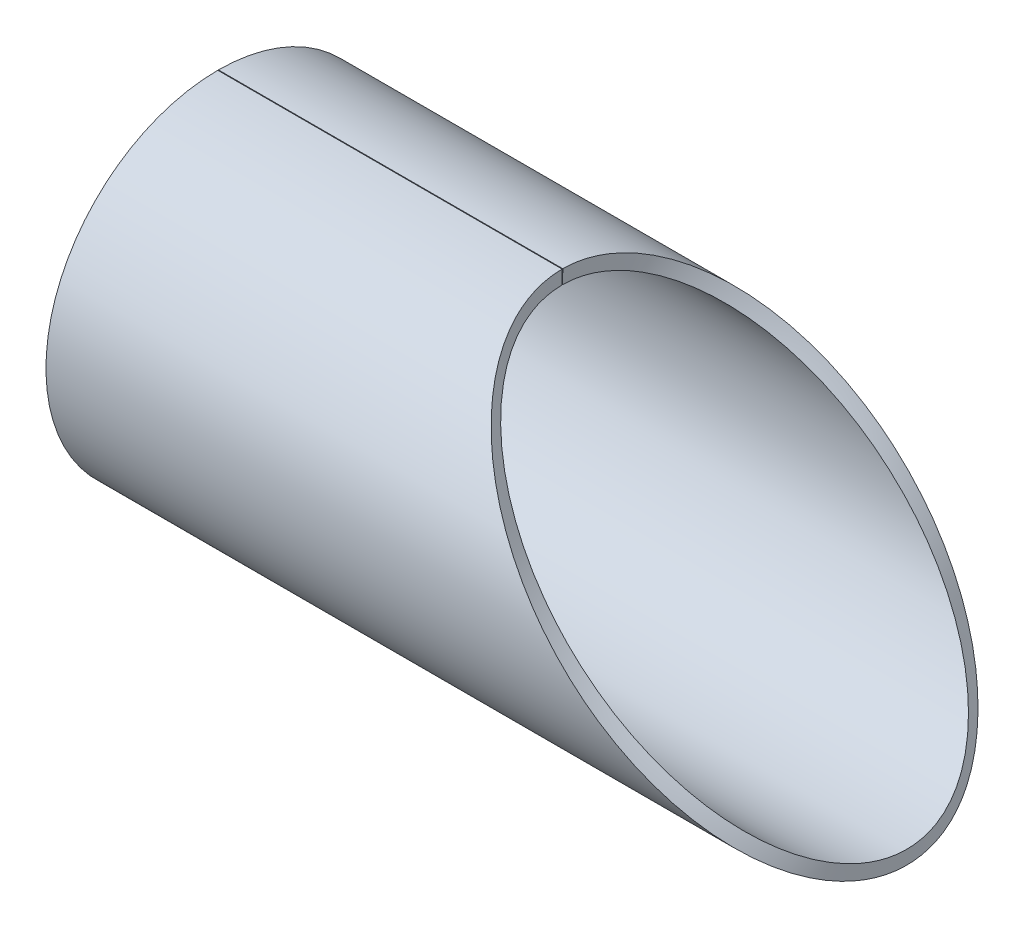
ISO-10303-21;
HEADER;
FILE_DESCRIPTION(('STEP AP214'),'2;1');
FILE_NAME('part.step','',(''),(''),'','','');
FILE_SCHEMA(('AUTOMOTIVE_DESIGN { 1 0 10303 214 1 1 1 1 }'));
ENDSEC;
DATA;
#1=APPLICATION_CONTEXT('core data for automotive mechanical design processes');
#2=APPLICATION_PROTOCOL_DEFINITION('international standard','automotive_design',2000,#1);
#3=PRODUCT_CONTEXT('',#1,'mechanical');
#4=PRODUCT('Part','Part','',(#3));
#5=PRODUCT_RELATED_PRODUCT_CATEGORY('part','',(#4));
#6=PRODUCT_DEFINITION_FORMATION('','',#4);
#7=PRODUCT_DEFINITION_CONTEXT('part definition',#1,'design');
#8=PRODUCT_DEFINITION('design','',#6,#7);
#9=PRODUCT_DEFINITION_SHAPE('','',#8);
#10=(LENGTH_UNIT() NAMED_UNIT(*) SI_UNIT(.MILLI.,.METRE.));
#11=(NAMED_UNIT(*) PLANE_ANGLE_UNIT() SI_UNIT($,.RADIAN.));
#12=(NAMED_UNIT(*) SI_UNIT($,.STERADIAN.) SOLID_ANGLE_UNIT());
#13=UNCERTAINTY_MEASURE_WITH_UNIT(LENGTH_MEASURE(1.E-05),#10,'distance_accuracy_value','');
#14=(GEOMETRIC_REPRESENTATION_CONTEXT(3) GLOBAL_UNCERTAINTY_ASSIGNED_CONTEXT((#13)) GLOBAL_UNIT_ASSIGNED_CONTEXT((#10,
#11,#12)) REPRESENTATION_CONTEXT('',''));
#15=CARTESIAN_POINT('',(0.,0.,0.));
#16=DIRECTION('',(0.,0.,1.));
#17=DIRECTION('',(1.,0.,0.));
#18=AXIS2_PLACEMENT_3D('',#15,#16,#17);
#19=CARTESIAN_POINT('',(25.0000250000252,23.6999525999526,0.0473999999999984));
#20=DIRECTION('',(0.,0.00200000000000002,-0.999997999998));
#21=DIRECTION('',(-1.,0.,0.));
#22=AXIS2_PLACEMENT_3D('',#19,#20,#21);
#23=PLANE('',#22);
#24=CARTESIAN_POINT('',(50.0000500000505,22.999953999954,0.0460000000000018));
#25=CARTESIAN_POINT('',(50.0000500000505,24.99994999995,0.0500000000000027));
#26=B_SPLINE_CURVE_WITH_KNOTS('',1,(#24,#25),.UNSPECIFIED.,.F.,.F.,(2,2),(0.,1.),.UNSPECIFIED.);
#27=CARTESIAN_POINT('',(50.0000500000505,22.999953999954,0.0459999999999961));
#28=VERTEX_POINT('',#27);
#29=CARTESIAN_POINT('',(50.0000500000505,24.99994999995,0.0499999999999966));
#30=VERTEX_POINT('',#29);
#31=EDGE_CURVE('E13',#28,#30,#26,.T.);
#32=ORIENTED_EDGE('',*,*,#31,.F.);
#33=DIRECTION('',(-1.,0.,0.));
#34=VECTOR('',#33,1.);
#35=CARTESIAN_POINT('',(231.312034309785,22.999953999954,0.0459999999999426));
#36=LINE('',#35,#34);
#37=CARTESIAN_POINT('',(0.,22.999953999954,0.0459999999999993));
#38=VERTEX_POINT('',#37);
#39=EDGE_CURVE('E195',#28,#38,#36,.T.);
#40=ORIENTED_EDGE('',*,*,#39,.T.);
#41=DIRECTION('',(0.,0.999997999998,0.00199999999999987));
#42=VECTOR('',#41,1.);
#43=CARTESIAN_POINT('',(0.,23.6999525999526,0.0474000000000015));
#44=LINE('',#43,#42);
#45=CARTESIAN_POINT('',(0.,24.99994999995,0.0499999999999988));
#46=VERTEX_POINT('',#45);
#47=EDGE_CURVE('E50',#38,#46,#44,.T.);
#48=ORIENTED_EDGE('',*,*,#47,.T.);
#49=DIRECTION('',(-1.,0.,0.));
#50=VECTOR('',#49,1.);
#51=CARTESIAN_POINT('',(231.312034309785,24.99994999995,0.0499999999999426));
#52=LINE('',#51,#50);
#53=EDGE_CURVE('E101',#30,#46,#52,.T.);
#54=ORIENTED_EDGE('',*,*,#53,.F.);
#55=EDGE_LOOP('',(#32,#40,#48,#54));
#56=FACE_BOUND('',#55,.T.);
#57=ADVANCED_FACE('F36',(#56),#23,.T.);
#58=CARTESIAN_POINT('',(0.,0.,0.));
#59=DIRECTION('',(-1.,0.,0.));
#60=DIRECTION('',(0.,0.,1.));
#61=AXIS2_PLACEMENT_3D('',#58,#59,#60);
#62=PLANE('',#61);
#63=ORIENTED_EDGE('',*,*,#47,.F.);
#64=CARTESIAN_POINT('',(0.,0.,0.));
#65=DIRECTION('',(-1.,0.,0.));
#66=DIRECTION('',(0.,0.,1.));
#67=AXIS2_PLACEMENT_3D('',#64,#65,#66);
#68=CIRCLE('',#67,23.);
#69=CARTESIAN_POINT('',(0.,22.999953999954,-0.0459999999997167));
#70=VERTEX_POINT('',#69);
#71=EDGE_CURVE('E93',#38,#70,#68,.F.);
#72=ORIENTED_EDGE('',*,*,#71,.T.);
#73=DIRECTION('',(0.,0.999997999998,-0.00199999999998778));
#74=VECTOR('',#73,1.);
#75=CARTESIAN_POINT('',(0.,23.6999525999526,-0.0473999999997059));
#76=LINE('',#75,#74);
#77=CARTESIAN_POINT('',(0.,24.99994999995,-0.0499999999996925));
#78=VERTEX_POINT('',#77);
#79=EDGE_CURVE('E88',#70,#78,#76,.T.);
#80=ORIENTED_EDGE('',*,*,#79,.T.);
#81=CARTESIAN_POINT('',(0.,0.,0.));
#82=DIRECTION('',(-1.,0.,0.));
#83=DIRECTION('',(0.,0.,1.));
#84=AXIS2_PLACEMENT_3D('',#81,#82,#83);
#85=CIRCLE('',#84,25.);
#86=EDGE_CURVE('E91',#46,#78,#85,.F.);
#87=ORIENTED_EDGE('',*,*,#86,.F.);
#88=EDGE_LOOP('',(#63,#72,#80,#87));
#89=FACE_BOUND('',#88,.T.);
#90=ADVANCED_FACE('F90',(#89),#62,.T.);
#91=CARTESIAN_POINT('',(25.0000250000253,23.6999525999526,-0.0473999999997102));
#92=DIRECTION('',(0.,-0.00199999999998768,-0.999997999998));
#93=DIRECTION('',(-1.,0.,0.));
#94=AXIS2_PLACEMENT_3D('',#91,#92,#93);
#95=PLANE('',#94);
#96=ORIENTED_EDGE('',*,*,#79,.F.);
#97=DIRECTION('',(-1.,0.,0.));
#98=VECTOR('',#97,1.);
#99=CARTESIAN_POINT('',(231.312034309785,22.999953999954,-0.0459999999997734));
#100=LINE('',#99,#98);
#101=CARTESIAN_POINT('',(50.0000500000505,22.999953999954,-0.0459999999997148));
#102=VERTEX_POINT('',#101);
#103=EDGE_CURVE('E102',#102,#70,#100,.T.);
#104=ORIENTED_EDGE('',*,*,#103,.F.);
#105=CARTESIAN_POINT('',(50.0000500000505,24.99994999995,-0.0499999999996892));
#106=CARTESIAN_POINT('',(50.0000500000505,22.999953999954,-0.0459999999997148));
#107=B_SPLINE_CURVE_WITH_KNOTS('',1,(#105,#106),.UNSPECIFIED.,.F.,.F.,(2,2),(0.,1.),.UNSPECIFIED.);
#108=CARTESIAN_POINT('',(50.0000500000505,24.99994999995,-0.0499999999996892));
#109=VERTEX_POINT('',#108);
#110=EDGE_CURVE('E58',#102,#109,#107,.F.);
#111=ORIENTED_EDGE('',*,*,#110,.T.);
#112=DIRECTION('',(-1.,0.,0.));
#113=VECTOR('',#112,1.);
#114=CARTESIAN_POINT('',(231.312034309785,24.99994999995,-0.0499999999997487));
#115=LINE('',#114,#113);
#116=EDGE_CURVE('E100',#109,#78,#115,.T.);
#117=ORIENTED_EDGE('',*,*,#116,.T.);
#118=EDGE_LOOP('',(#96,#104,#111,#117));
#119=FACE_BOUND('',#118,.T.);
#120=ADVANCED_FACE('F104',(#119),#95,.F.);
#121=CARTESIAN_POINT('',(50.0000500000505,24.99994999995,-0.0499999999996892));
#122=CARTESIAN_POINT('',(50.0016305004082,24.9994612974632,-0.294350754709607));
#123=CARTESIAN_POINT('',(50.004808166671,24.9955102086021,-0.507621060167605));
#124=CARTESIAN_POINT('',(50.0119705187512,24.9879679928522,-0.780870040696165));
#125=CARTESIAN_POINT('',(50.0147585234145,24.9852496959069,-0.862732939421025));
#126=CARTESIAN_POINT('',(50.0211165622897,24.9789104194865,-1.03007026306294));
#127=CARTESIAN_POINT('',(50.024688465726,24.9753333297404,-1.11338319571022));
#128=CARTESIAN_POINT('',(50.0445124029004,24.9554625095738,-1.52815054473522));
#129=CARTESIAN_POINT('',(50.066642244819,24.9333416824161,-1.85377885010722));
#130=CARTESIAN_POINT('',(50.1527118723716,24.8473146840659,-2.83602660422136));
#131=CARTESIAN_POINT('',(50.2360171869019,24.7639922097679,-3.49023949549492));
#132=CARTESIAN_POINT('',(50.5647063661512,24.4353705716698,-5.446190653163));
#133=CARTESIAN_POINT('',(50.8880864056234,24.1119034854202,-6.73974140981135));
#134=CARTESIAN_POINT('',(51.7502468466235,23.2499034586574,-9.28708744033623));
#135=CARTESIAN_POINT('',(52.2873999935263,22.7124395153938,-10.5373648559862));
#136=CARTESIAN_POINT('',(53.580288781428,21.419700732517,-12.9648519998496));
#137=CARTESIAN_POINT('',(54.3389387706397,20.6610239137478,-14.1475586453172));
#138=CARTESIAN_POINT('',(55.6452221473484,19.3547186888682,-15.8399083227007));
#139=CARTESIAN_POINT('',(56.1090596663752,18.891049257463,-16.3909401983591));
#140=CARTESIAN_POINT('',(57.0994500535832,17.9007626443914,-17.4670363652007));
#141=CARTESIAN_POINT('',(57.6252002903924,17.3749314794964,-17.9910330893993));
#142=CARTESIAN_POINT('',(58.7378108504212,16.2621442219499,-19.0028466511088));
#143=CARTESIAN_POINT('',(59.3233651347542,15.6766751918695,-19.4897948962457));
#144=CARTESIAN_POINT('',(60.5709801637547,14.4292687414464,-20.4305274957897));
#145=CARTESIAN_POINT('',(61.2313678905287,13.7688378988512,-20.882716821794));
#146=CARTESIAN_POINT('',(62.2768197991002,12.723213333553,-21.5241035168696));
#147=CARTESIAN_POINT('',(62.6333185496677,12.3666509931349,-21.7311370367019));
#148=CARTESIAN_POINT('',(63.3702785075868,11.6297674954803,-22.134246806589));
#149=CARTESIAN_POINT('',(63.7516951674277,11.2484569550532,-22.3307815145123));
#150=CARTESIAN_POINT('',(64.9347551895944,10.0655560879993,-22.900893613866));
#151=CARTESIAN_POINT('',(65.7752085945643,9.22485385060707,-23.2550569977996));
#152=CARTESIAN_POINT('',(67.1135087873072,7.88647861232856,-23.7281974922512));
#153=CARTESIAN_POINT('',(67.583066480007,7.41713894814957,-23.879982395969));
#154=CARTESIAN_POINT('',(68.5772992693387,6.42313189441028,-24.166317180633));
#155=CARTESIAN_POINT('',(69.1006466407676,5.89976463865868,-24.3004006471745));
#156=CARTESIAN_POINT('',(69.9250141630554,5.07518635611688,-24.4810468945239));
#157=CARTESIAN_POINT('',(70.206361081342,4.79374635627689,-24.5378423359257));
#158=CARTESIAN_POINT('',(70.5662419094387,4.43378439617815,-24.6037987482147));
#159=CARTESIAN_POINT('',(70.63862793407,4.36138408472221,-24.6167380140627));
#160=CARTESIAN_POINT('',(70.7842197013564,4.21576994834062,-24.6420929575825));
#161=CARTESIAN_POINT('',(70.8565217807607,4.14345223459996,-24.6543642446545));
#162=CARTESIAN_POINT('',(71.0834005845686,3.91661485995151,-24.6917722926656));
#163=CARTESIAN_POINT('',(71.2472485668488,3.75289757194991,-24.7173519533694));
#164=CARTESIAN_POINT('',(72.1294657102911,2.87144440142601,-24.8447670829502));
#165=CARTESIAN_POINT('',(73.0367665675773,1.96427871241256,-24.9474268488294));
#166=CARTESIAN_POINT('',(74.4228015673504,0.57736638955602,-24.9948730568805));
#167=CARTESIAN_POINT('',(74.7126040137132,0.287398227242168,-25.0001769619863));
#168=CARTESIAN_POINT('',(75.3173997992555,-0.317402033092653,-24.9998140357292));
#169=CARTESIAN_POINT('',(75.6075459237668,-0.60770974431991,-24.9941574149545));
#170=CARTESIAN_POINT('',(76.4401366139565,-1.44081985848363,-24.9646330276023));
#171=CARTESIAN_POINT('',(76.9452184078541,-1.94623019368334,-24.9283213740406));
#172=CARTESIAN_POINT('',(77.8554246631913,-2.85637323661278,-24.8404941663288));
#173=CARTESIAN_POINT('',(78.260549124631,-3.26113814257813,-24.7889810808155));
#174=CARTESIAN_POINT('',(78.7932678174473,-3.79340469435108,-24.7111762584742));
#175=CARTESIAN_POINT('',(78.9583460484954,-3.95835503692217,-24.6851239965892));
#176=CARTESIAN_POINT('',(79.1872213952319,-4.1871948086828,-24.6469750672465));
#177=CARTESIAN_POINT('',(79.2604425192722,-4.2604316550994,-24.6344134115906));
#178=CARTESIAN_POINT('',(79.40784684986,-4.40785822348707,-24.6084617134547));
#179=CARTESIAN_POINT('',(79.4811294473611,-4.48115505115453,-24.5952178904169));
#180=CARTESIAN_POINT('',(80.7198009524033,-5.72010105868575,-24.3656894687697));
#181=CARTESIAN_POINT('',(81.7782000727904,-6.77854382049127,-24.0842428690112));
#182=CARTESIAN_POINT('',(82.9669372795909,-7.96695177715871,-23.6978932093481));
#183=CARTESIAN_POINT('',(83.1970534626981,-8.19703638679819,-23.6191875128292));
#184=CARTESIAN_POINT('',(83.6482687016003,-8.6482848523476,-23.4577192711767));
#185=CARTESIAN_POINT('',(83.8705339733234,-8.87058719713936,-23.3745145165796));
#186=CARTESIAN_POINT('',(84.5273027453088,-9.52746408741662,-23.1181403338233));
#187=CARTESIAN_POINT('',(84.951779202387,-9.95199944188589,-22.9382163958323));
#188=CARTESIAN_POINT('',(85.7739933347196,-10.7741914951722,-22.5637067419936));
#189=CARTESIAN_POINT('',(86.171731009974,-11.1718494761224,-22.3691215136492));
#190=CARTESIAN_POINT('',(86.9404675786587,-11.9404499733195,-21.9684654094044));
#191=CARTESIAN_POINT('',(87.3101722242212,-12.3101530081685,-21.7631574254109));
#192=CARTESIAN_POINT('',(88.3915183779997,-13.3916692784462,-21.1272986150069));
#193=CARTESIAN_POINT('',(89.0745739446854,-14.0748409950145,-20.6769412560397));
#194=CARTESIAN_POINT('',(90.365001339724,-15.365103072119,-19.7370376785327));
#195=CARTESIAN_POINT('',(90.9702527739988,-15.9701930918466,-19.2493560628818));
#196=CARTESIAN_POINT('',(92.68997482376,-17.6901698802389,-17.7312434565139));
#197=CARTESIAN_POINT('',(93.7100038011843,-18.7100257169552,-16.6440459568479));
#198=CARTESIAN_POINT('',(95.5037024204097,-20.5035895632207,-14.3767918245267));
#199=CARTESIAN_POINT('',(96.2858025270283,-21.285864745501,-13.1854818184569));
#200=CARTESIAN_POINT('',(97.2868288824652,-22.2867146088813,-11.3485062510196));
#201=CARTESIAN_POINT('',(97.5917282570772,-22.5916554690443,-10.7280326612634));
#202=CARTESIAN_POINT('',(98.1475563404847,-23.1476165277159,-9.46897199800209));
#203=CARTESIAN_POINT('',(98.3980634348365,-23.3981628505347,-8.8311898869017));
#204=CARTESIAN_POINT('',(99.0673638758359,-24.0673842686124,-6.90049076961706));
#205=CARTESIAN_POINT('',(99.4031486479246,-24.403220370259,-5.59321612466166));
#206=CARTESIAN_POINT('',(99.8613919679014,-24.8617723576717,-2.94847524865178));
#207=CARTESIAN_POINT('',(99.9834443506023,-24.9835295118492,-1.61228551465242));
#208=CARTESIAN_POINT('',(100.013410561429,-25.0133428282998,1.05303941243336));
#209=CARTESIAN_POINT('',(99.9213160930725,-24.921673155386,2.38915881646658));
#210=CARTESIAN_POINT('',(99.5229631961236,-24.5231604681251,5.04107859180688));
#211=CARTESIAN_POINT('',(99.2174964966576,-24.2174427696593,6.35303141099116));
#212=CARTESIAN_POINT('',(98.3862779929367,-23.386423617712,8.93983963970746));
#213=CARTESIAN_POINT('',(97.8614214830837,-22.8613000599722,10.212115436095));
#214=CARTESIAN_POINT('',(96.5904725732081,-21.590399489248,12.6799444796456));
#215=CARTESIAN_POINT('',(95.8400348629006,-20.8400591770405,13.8839197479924));
#216=CARTESIAN_POINT('',(94.5419334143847,-19.5418598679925,15.6087647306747));
#217=CARTESIAN_POINT('',(94.0807513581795,-19.0808106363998,16.169938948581));
#218=CARTESIAN_POINT('',(93.0938796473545,-18.0941014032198,17.2669555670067));
#219=CARTESIAN_POINT('',(92.5690514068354,-17.5692398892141,17.8016359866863));
#220=CARTESIAN_POINT('',(91.4566101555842,-16.4566114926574,18.8349773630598));
#221=CARTESIAN_POINT('',(90.8709044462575,-15.8708911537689,19.3322434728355));
#222=CARTESIAN_POINT('',(89.6217937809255,-14.6220154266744,20.2932867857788));
#223=CARTESIAN_POINT('',(88.9595041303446,-13.9597485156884,20.7559022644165));
#224=CARTESIAN_POINT('',(87.5594561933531,-12.5594779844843,21.6319571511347));
#225=CARTESIAN_POINT('',(86.8246033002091,-11.8246428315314,22.0443892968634));
#226=CARTESIAN_POINT('',(85.2421861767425,-10.2423935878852,22.8225908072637));
#227=CARTESIAN_POINT('',(84.3987830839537,-9.39876488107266,23.1855608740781));
#228=CARTESIAN_POINT('',(83.2792860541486,-8.27927477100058,23.5904704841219));
#229=CARTESIAN_POINT('',(83.0519754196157,-8.05200624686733,23.6691005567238));
#230=CARTESIAN_POINT('',(82.5821488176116,-7.58232841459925,23.8237155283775));
#231=CARTESIAN_POINT('',(82.3407143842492,-7.34098531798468,23.8993046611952));
#232=CARTESIAN_POINT('',(81.5968476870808,-6.59731764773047,24.1193431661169));
#233=CARTESIAN_POINT('',(81.0748520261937,-6.07532427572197,24.2570902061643));
#234=CARTESIAN_POINT('',(80.2527317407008,-5.25299411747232,24.4435073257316));
#235=CARTESIAN_POINT('',(79.9721705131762,-4.9723345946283,24.502272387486));
#236=CARTESIAN_POINT('',(79.5415469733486,-4.54159194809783,24.5844525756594));
#237=CARTESIAN_POINT('',(79.396375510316,-4.39638605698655,24.610851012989));
#238=CARTESIAN_POINT('',(79.176172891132,-4.17615378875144,24.6488395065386));
#239=CARTESIAN_POINT('',(79.1021642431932,-4.1021425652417,24.6612783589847));
#240=CARTESIAN_POINT('',(78.9463828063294,-3.94641649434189,24.686676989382));
#241=CARTESIAN_POINT('',(78.865470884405,-3.86555366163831,24.6994877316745));
#242=CARTESIAN_POINT('',(78.1100727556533,-3.1107017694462,24.8150013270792));
#243=CARTESIAN_POINT('',(77.2452507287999,-2.24640715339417,24.9214230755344));
#244=CARTESIAN_POINT('',(75.9225269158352,-0.922859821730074,24.9843662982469));
#245=CARTESIAN_POINT('',(75.6458973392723,-0.646043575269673,24.9933201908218));
#246=CARTESIAN_POINT('',(75.2128257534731,-0.212833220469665,24.9995111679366));
#247=CARTESIAN_POINT('',(75.063985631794,-0.0639952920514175,25.00035973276));
#248=CARTESIAN_POINT('',(74.7668030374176,0.233204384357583,24.999353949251));
#249=CARTESIAN_POINT('',(74.621261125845,0.378792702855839,24.9975368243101));
#250=CARTESIAN_POINT('',(73.9087984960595,1.09157515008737,24.9826692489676));
#251=CARTESIAN_POINT('',(73.3876185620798,1.61320728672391,24.9524020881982));
#252=CARTESIAN_POINT('',(72.4428390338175,2.55817928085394,24.8732894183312));
#253=CARTESIAN_POINT('',(72.0192394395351,2.98155093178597,24.8244472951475));
#254=CARTESIAN_POINT('',(71.4570253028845,3.54331152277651,24.7483464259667));
#255=CARTESIAN_POINT('',(71.2818181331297,3.71835839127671,24.7224797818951));
#256=CARTESIAN_POINT('',(70.9557988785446,4.04418165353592,24.6712746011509));
#257=CARTESIAN_POINT('',(70.808394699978,4.19159070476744,24.6465580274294));
#258=CARTESIAN_POINT('',(69.4863233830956,5.5138555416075,24.4135563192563));
#259=CARTESIAN_POINT('',(68.4162966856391,6.58420379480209,24.1385994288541));
#260=CARTESIAN_POINT('',(66.968978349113,8.03105073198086,23.6803326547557));
#261=CARTESIAN_POINT('',(66.5162561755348,8.48371356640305,23.5212893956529));
#262=CARTESIAN_POINT('',(65.6312739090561,9.36878235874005,23.1829758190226));
#263=CARTESIAN_POINT('',(65.2020680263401,9.79806118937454,23.0044704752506));
#264=CARTESIAN_POINT('',(64.3702267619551,10.6299295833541,22.6321068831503));
#265=CARTESIAN_POINT('',(63.967591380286,11.0325204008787,22.4382491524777));
#266=CARTESIAN_POINT('',(63.1888911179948,11.811115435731,22.0383548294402));
#267=CARTESIAN_POINT('',(62.8140209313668,12.1859601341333,21.8330100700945));
#268=CARTESIAN_POINT('',(61.719682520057,13.2804568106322,21.1976715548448));
#269=CARTESIAN_POINT('',(61.0283628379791,13.9719297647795,20.7468901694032));
#270=CARTESIAN_POINT('',(60.0487422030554,14.951442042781,20.0403704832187));
#271=CARTESIAN_POINT('',(59.731761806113,15.2683461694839,19.7997982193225));
#272=CARTESIAN_POINT('',(59.1169206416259,15.8830658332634,19.3101689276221));
#273=CARTESIAN_POINT('',(58.8194513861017,16.1805145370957,19.0614670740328));
#274=CARTESIAN_POINT('',(57.3697018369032,17.630415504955,17.7917310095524));
#275=CARTESIAN_POINT('',(56.3378342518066,18.6621968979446,16.6986560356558));
#276=CARTESIAN_POINT('',(54.5242807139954,20.4756020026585,14.4177816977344));
#277=CARTESIAN_POINT('',(53.7340564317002,21.2659870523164,13.2186092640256));
#278=CARTESIAN_POINT('',(52.7235487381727,22.2763303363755,11.3691937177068));
#279=CARTESIAN_POINT('',(52.4159238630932,22.5840130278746,10.7444319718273));
#280=CARTESIAN_POINT('',(51.8554118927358,23.144663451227,9.47655087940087));
#281=CARTESIAN_POINT('',(51.6029646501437,23.3971450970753,8.83425780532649));
#282=CARTESIAN_POINT('',(50.9290491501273,24.0709660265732,6.88989355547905));
#283=CARTESIAN_POINT('',(50.5917197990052,24.4083597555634,5.57226096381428));
#284=CARTESIAN_POINT('',(50.2483514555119,24.7516658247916,3.57904574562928));
#285=CARTESIAN_POINT('',(50.1611744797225,24.8388520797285,2.91215109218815));
#286=CARTESIAN_POINT('',(50.0708637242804,24.9291162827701,1.91087951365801));
#287=CARTESIAN_POINT('',(50.0475955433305,24.9523696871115,1.57917170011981));
#288=CARTESIAN_POINT('',(50.0266339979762,24.9733720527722,1.15665328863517));
#289=CARTESIAN_POINT('',(50.0228474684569,24.9771626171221,1.07174468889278));
#290=CARTESIAN_POINT('',(50.0160859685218,24.9839000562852,0.901125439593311));
#291=CARTESIAN_POINT('',(50.0131098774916,24.9867613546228,0.818692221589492));
#292=CARTESIAN_POINT('',(50.0054085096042,24.9947993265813,0.542223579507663));
#293=CARTESIAN_POINT('',(50.0019109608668,24.999416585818,0.316706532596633));
#294=CARTESIAN_POINT('',(50.0000500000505,24.99994999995,0.0500000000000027));
#295=CARTESIAN_POINT('',(50.0000500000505,22.999953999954,-0.0459999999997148));
#296=CARTESIAN_POINT('',(50.001630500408,22.9995043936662,-0.270802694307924));
#297=CARTESIAN_POINT('',(50.004808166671,22.9958693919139,-0.467011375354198));
#298=CARTESIAN_POINT('',(50.0119705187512,22.988930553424,-0.718400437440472));
#299=CARTESIAN_POINT('',(50.0147585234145,22.9864297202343,-0.793714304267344));
#300=CARTESIAN_POINT('',(50.0211165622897,22.9805975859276,-0.947664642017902));
#301=CARTESIAN_POINT('',(50.024688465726,22.9773066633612,-1.0243125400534));
#302=CARTESIAN_POINT('',(50.0445124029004,22.9590255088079,-1.4058985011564));
#303=CARTESIAN_POINT('',(50.066642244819,22.9386743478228,-1.70547654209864));
#304=CARTESIAN_POINT('',(50.1527118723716,22.8595295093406,-2.60914447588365));
#305=CARTESIAN_POINT('',(50.2360171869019,22.7828728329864,-3.21102033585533));
#306=CARTESIAN_POINT('',(50.5647063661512,22.4805409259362,-5.01049540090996));
#307=CARTESIAN_POINT('',(50.8880864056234,22.1829512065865,-6.20056209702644));
#308=CARTESIAN_POINT('',(51.7502468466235,21.3899111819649,-8.54412044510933));
#309=CARTESIAN_POINT('',(52.2873999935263,20.8954443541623,-9.69437566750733));
#310=CARTESIAN_POINT('',(53.580288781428,19.7061246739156,-11.9276638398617));
#311=CARTESIAN_POINT('',(54.3389387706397,19.008142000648,-13.0157539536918));
#312=CARTESIAN_POINT('',(55.6452221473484,17.8063411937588,-14.5727156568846));
#313=CARTESIAN_POINT('',(56.1090596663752,17.379765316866,-15.0796649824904));
#314=CARTESIAN_POINT('',(57.0994500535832,16.4687016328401,-16.0696734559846));
#315=CARTESIAN_POINT('',(57.6252002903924,15.9849369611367,-16.5517504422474));
#316=CARTESIAN_POINT('',(58.7378108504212,14.9611726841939,-17.4826189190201));
#317=CARTESIAN_POINT('',(59.3233651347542,14.4225411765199,-17.930611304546));
#318=CARTESIAN_POINT('',(60.5709801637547,13.2749272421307,-18.7960852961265));
#319=CARTESIAN_POINT('',(61.2313678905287,12.6673308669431,-19.2120994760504));
#320=CARTESIAN_POINT('',(62.2768197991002,11.7053562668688,-19.80217523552));
#321=CARTESIAN_POINT('',(62.6333185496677,11.3773189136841,-19.9926460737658));
#322=CARTESIAN_POINT('',(63.3702785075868,10.6993860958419,-20.3635070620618));
#323=CARTESIAN_POINT('',(63.7516951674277,10.3485803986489,-20.5443189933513));
#324=CARTESIAN_POINT('',(64.9347551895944,9.26031160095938,-21.0688221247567));
#325=CARTESIAN_POINT('',(65.7752085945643,8.4868655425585,-21.3946524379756));
#326=CARTESIAN_POINT('',(67.1135087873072,7.25556032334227,-21.8299416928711));
#327=CARTESIAN_POINT('',(67.583066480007,6.82376783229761,-21.9695838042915));
#328=CARTESIAN_POINT('',(68.5772992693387,5.90928134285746,-22.2330118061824));
#329=CARTESIAN_POINT('',(69.1006466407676,5.42778346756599,-22.3563685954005));
#330=CARTESIAN_POINT('',(69.9250141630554,4.66917144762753,-22.522563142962));
#331=CARTESIAN_POINT('',(70.206361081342,4.41024664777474,-22.5748149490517));
#332=CARTESIAN_POINT('',(70.5662419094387,4.0790816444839,-22.6354948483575));
#333=CARTESIAN_POINT('',(70.63862793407,4.01247335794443,-22.6473989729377));
#334=CARTESIAN_POINT('',(70.7842197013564,3.87850835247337,-22.6707255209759));
#335=CARTESIAN_POINT('',(70.8565217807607,3.81197605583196,-22.6820151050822));
#336=CARTESIAN_POINT('',(71.0834005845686,3.60328567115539,-22.7164305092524));
#337=CARTESIAN_POINT('',(71.2472485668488,3.45266576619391,-22.7399637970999));
#338=CARTESIAN_POINT('',(72.1294657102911,2.64172884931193,-22.8571857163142));
#339=CARTESIAN_POINT('',(73.0367665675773,1.80713641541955,-22.951632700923));
#340=CARTESIAN_POINT('',(74.4228015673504,0.531177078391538,-22.99528321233));
#341=CARTESIAN_POINT('',(74.7126040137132,0.264406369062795,-23.0001628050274));
#342=CARTESIAN_POINT('',(75.3173997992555,-0.292009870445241,-22.9998289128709));
#343=CARTESIAN_POINT('',(75.6075459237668,-0.559092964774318,-22.9946248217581));
#344=CARTESIAN_POINT('',(76.4401366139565,-1.32555426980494,-22.9674623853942));
#345=CARTESIAN_POINT('',(76.9452184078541,-1.79053177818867,-22.9340556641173));
#346=CARTESIAN_POINT('',(77.8554246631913,-2.62786337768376,-22.8532546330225));
#347=CARTESIAN_POINT('',(78.260549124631,-3.00024709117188,-22.8058625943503));
#348=CARTESIAN_POINT('',(78.7932678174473,-3.48993231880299,-22.7342821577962));
#349=CARTESIAN_POINT('',(78.9583460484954,-3.6416866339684,-22.7103140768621));
#350=CARTESIAN_POINT('',(79.1872213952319,-3.85221922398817,-22.6752170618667));
#351=CARTESIAN_POINT('',(79.2604425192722,-3.91959712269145,-22.6636603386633));
#352=CARTESIAN_POINT('',(79.40784684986,-4.0552295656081,-22.6397847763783));
#353=CARTESIAN_POINT('',(79.4811294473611,-4.12266264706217,-22.6276004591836));
#354=CARTESIAN_POINT('',(80.7198009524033,-5.26249297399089,-22.4164343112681));
#355=CARTESIAN_POINT('',(81.7782000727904,-6.23626031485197,-22.1575034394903));
#356=CARTESIAN_POINT('',(82.9669372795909,-7.32959563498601,-21.8020617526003));
#357=CARTESIAN_POINT('',(83.1970534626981,-7.54127347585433,-21.7296525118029));
#358=CARTESIAN_POINT('',(83.6482687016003,-7.95642206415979,-21.5811017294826));
#359=CARTESIAN_POINT('',(83.8705339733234,-8.16094022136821,-21.5045533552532));
#360=CARTESIAN_POINT('',(84.5273027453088,-8.76526696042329,-21.2686891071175));
#361=CARTESIAN_POINT('',(84.951779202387,-9.15583948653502,-21.1031590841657));
#362=CARTESIAN_POINT('',(85.7739933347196,-9.91225617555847,-20.7586102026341));
#363=CARTESIAN_POINT('',(86.171731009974,-10.2781015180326,-20.5795917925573));
#364=CARTESIAN_POINT('',(86.9404675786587,-10.9852139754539,-20.210988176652));
#365=CARTESIAN_POINT('',(87.3101722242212,-11.325340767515,-20.0221048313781));
#366=CARTESIAN_POINT('',(88.3915183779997,-12.3203357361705,-19.4371147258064));
#367=CARTESIAN_POINT('',(89.0745739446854,-12.9488537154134,-19.0227859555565));
#368=CARTESIAN_POINT('',(90.365001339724,-14.1358948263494,-18.15807466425));
#369=CARTESIAN_POINT('',(90.9702527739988,-14.6925776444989,-17.7094075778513));
#370=CARTESIAN_POINT('',(92.68997482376,-16.2749562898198,-16.3127439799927));
#371=CARTESIAN_POINT('',(93.7100038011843,-17.2132236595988,-15.3125222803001));
#372=CARTESIAN_POINT('',(95.5037024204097,-18.8633023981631,-13.2266484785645));
#373=CARTESIAN_POINT('',(96.2858025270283,-19.5829955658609,-12.1306432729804));
#374=CARTESIAN_POINT('',(97.2868288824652,-20.5037774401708,-10.440625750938));
#375=CARTESIAN_POINT('',(97.5917282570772,-20.7843230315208,-9.8697900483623));
#376=CARTESIAN_POINT('',(98.1475563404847,-21.2958072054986,-8.71145423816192));
#377=CARTESIAN_POINT('',(98.3980634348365,-21.5263098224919,-8.12469469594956));
#378=CARTESIAN_POINT('',(99.0673638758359,-22.1419935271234,-6.3484515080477));
#379=CARTESIAN_POINT('',(99.4031486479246,-22.4509627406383,-5.14575883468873));
#380=CARTESIAN_POINT('',(99.8613919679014,-22.8728305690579,-2.71259722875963));
#381=CARTESIAN_POINT('',(99.9834443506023,-22.9848471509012,-1.48330267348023));
#382=CARTESIAN_POINT('',(100.013410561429,-23.0122754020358,0.968796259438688));
#383=CARTESIAN_POINT('',(99.9213160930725,-22.9279393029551,2.19802611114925));
#384=CARTESIAN_POINT('',(99.5229631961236,-22.5613076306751,4.63779230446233));
#385=CARTESIAN_POINT('',(99.2174964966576,-22.2800473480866,5.84478889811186));
#386=CARTESIAN_POINT('',(98.3862779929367,-21.5155097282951,8.22465246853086));
#387=CARTESIAN_POINT('',(97.8614214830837,-21.0323960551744,9.39514620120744));
#388=CARTESIAN_POINT('',(96.5904725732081,-19.8631675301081,11.665548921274));
#389=CARTESIAN_POINT('',(95.8400348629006,-19.1728544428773,12.773206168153));
#390=CARTESIAN_POINT('',(94.5419334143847,-17.9785110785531,14.3600635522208));
#391=CARTESIAN_POINT('',(94.0807513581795,-17.5543457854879,14.8763438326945));
#392=CARTESIAN_POINT('',(93.0938796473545,-16.6465732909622,15.8855991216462));
#393=CARTESIAN_POINT('',(92.5690514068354,-16.1637006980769,16.3775051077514));
#394=CARTESIAN_POINT('',(91.4566101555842,-15.1400825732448,17.328179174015));
#395=CARTESIAN_POINT('',(90.8709044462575,-14.6012198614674,17.7856639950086));
#396=CARTESIAN_POINT('',(89.6217937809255,-13.4522541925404,18.6698238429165));
#397=CARTESIAN_POINT('',(88.9595041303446,-12.8429686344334,19.0954300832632));
#398=CARTESIAN_POINT('',(87.5594561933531,-11.5547197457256,19.9014005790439));
#399=CARTESIAN_POINT('',(86.8246033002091,-10.8786714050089,20.2808381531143));
#400=CARTESIAN_POINT('',(85.2421861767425,-9.42300210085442,20.9967835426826));
#401=CARTESIAN_POINT('',(84.3987830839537,-8.64686369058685,21.3307160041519));
#402=CARTESIAN_POINT('',(83.2792860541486,-7.61693278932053,21.7032328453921));
#403=CARTESIAN_POINT('',(83.0519754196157,-7.40784574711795,21.7755725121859));
#404=CARTESIAN_POINT('',(82.5821488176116,-6.97574214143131,21.9178182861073));
#405=CARTESIAN_POINT('',(82.3407143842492,-6.7537064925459,21.9873602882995));
#406=CARTESIAN_POINT('',(81.5968476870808,-6.06953223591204,22.1897957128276));
#407=CARTESIAN_POINT('',(81.0748520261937,-5.58929833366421,22.3165229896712));
#408=CARTESIAN_POINT('',(80.2527317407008,-4.83275458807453,22.488026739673));
#409=CARTESIAN_POINT('',(79.9721705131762,-4.57454782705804,22.5420905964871));
#410=CARTESIAN_POINT('',(79.5415469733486,-4.17826459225,22.6176963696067));
#411=CARTESIAN_POINT('',(79.396375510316,-4.04467517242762,22.6419829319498));
#412=CARTESIAN_POINT('',(79.176172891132,-3.84206148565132,22.6769323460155));
#413=CARTESIAN_POINT('',(79.1021642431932,-3.77397116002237,22.6883760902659));
#414=CARTESIAN_POINT('',(78.9463828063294,-3.63070317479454,22.7117428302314));
#415=CARTESIAN_POINT('',(78.865470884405,-3.55630936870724,22.7235287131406));
#416=CARTESIAN_POINT('',(78.1100727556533,-2.86184562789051,22.8298012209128));
#417=CARTESIAN_POINT('',(77.2452507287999,-2.06669458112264,22.9277092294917));
#418=CARTESIAN_POINT('',(75.9225269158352,-0.849031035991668,22.9856169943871));
#419=CARTESIAN_POINT('',(75.6458973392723,-0.594360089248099,22.9938545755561));
#420=CARTESIAN_POINT('',(75.2128257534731,-0.195806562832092,22.9995502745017));
#421=CARTESIAN_POINT('',(75.063985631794,-0.0588756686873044,23.0003309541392));
#422=CARTESIAN_POINT('',(74.7668030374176,0.214548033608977,22.9994056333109));
#423=CARTESIAN_POINT('',(74.621261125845,0.348489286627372,22.9977338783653));
#424=CARTESIAN_POINT('',(73.9087984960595,1.00424913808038,22.9840557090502));
#425=CARTESIAN_POINT('',(73.3876185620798,1.484150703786,22.9562099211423));
#426=CARTESIAN_POINT('',(72.4428390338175,2.35352493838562,22.8834262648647));
#427=CARTESIAN_POINT('',(72.0192394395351,2.7430268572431,22.8384915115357));
#428=CARTESIAN_POINT('',(71.4570253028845,3.25984660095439,22.7684787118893));
#429=CARTESIAN_POINT('',(71.2818181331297,3.42088971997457,22.7446813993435));
#430=CARTESIAN_POINT('',(70.9557988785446,3.72064712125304,22.6975726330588));
#431=CARTESIAN_POINT('',(70.808394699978,3.85626344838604,22.674833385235));
#432=CARTESIAN_POINT('',(69.4863233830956,5.0727470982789,22.4604718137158));
#433=CARTESIAN_POINT('',(68.4162966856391,6.05746749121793,22.2075114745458));
#434=CARTESIAN_POINT('',(66.968978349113,7.38856667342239,21.7859060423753));
#435=CARTESIAN_POINT('',(66.5162561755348,7.8050164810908,21.6395862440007));
#436=CARTESIAN_POINT('',(65.6312739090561,8.61927977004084,21.3283377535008));
#437=CARTESIAN_POINT('',(65.2020680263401,9.01421629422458,21.1641128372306));
#438=CARTESIAN_POINT('',(64.3702267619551,9.77953521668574,20.8215383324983));
#439=CARTESIAN_POINT('',(63.967591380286,10.1499187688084,20.6431892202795));
#440=CARTESIAN_POINT('',(63.1888911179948,10.8662262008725,20.275286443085));
#441=CARTESIAN_POINT('',(62.8140209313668,11.2110833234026,20.086369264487));
#442=CARTESIAN_POINT('',(61.719682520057,12.2180202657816,19.5018578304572));
#443=CARTESIAN_POINT('',(61.0283628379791,12.8541753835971,19.0871389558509));
#444=CARTESIAN_POINT('',(60.0487422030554,13.7553266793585,18.4371408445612));
#445=CARTESIAN_POINT('',(59.731761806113,14.0468784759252,18.2158143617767));
#446=CARTESIAN_POINT('',(59.1169206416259,14.6124205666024,17.7653554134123));
#447=CARTESIAN_POINT('',(58.8194513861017,14.8860733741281,17.5365497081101));
#448=CARTESIAN_POINT('',(57.3697018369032,16.2199822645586,16.3683925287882));
#449=CARTESIAN_POINT('',(56.3378342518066,17.169221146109,15.3627635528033));
#450=CARTESIAN_POINT('',(54.5242807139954,18.8375538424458,13.2643591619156));
#451=CARTESIAN_POINT('',(53.7340564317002,19.5647080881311,12.1611205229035));
#452=CARTESIAN_POINT('',(52.7235487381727,20.4942239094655,10.4596582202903));
#453=CARTESIAN_POINT('',(52.4159238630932,20.7772919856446,9.88487741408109));
#454=CARTESIAN_POINT('',(51.8554118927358,21.2930903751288,8.7184268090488));
#455=CARTESIAN_POINT('',(51.6029646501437,21.5253734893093,8.12751718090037));
#456=CARTESIAN_POINT('',(50.9290491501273,22.1452887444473,6.33870207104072));
#457=CARTESIAN_POINT('',(50.5917197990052,22.4556909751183,5.12648008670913));
#458=CARTESIAN_POINT('',(50.2483514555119,22.7715325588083,3.29272208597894));
#459=CARTESIAN_POINT('',(50.1611744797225,22.8517439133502,2.6791790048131));
#460=CARTESIAN_POINT('',(50.0708637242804,22.9347869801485,1.75800915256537));
#461=CARTESIAN_POINT('',(50.0475955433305,22.9561801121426,1.45283796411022));
#462=CARTESIAN_POINT('',(50.0266339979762,22.9755022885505,1.06412102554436));
#463=CARTESIAN_POINT('',(50.0228474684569,22.9789896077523,0.98600511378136));
#464=CARTESIAN_POINT('',(50.0160859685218,22.9851880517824,0.829035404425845));
#465=CARTESIAN_POINT('',(50.0131098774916,22.9878204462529,0.753196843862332));
#466=CARTESIAN_POINT('',(50.0054085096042,22.9952153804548,0.498845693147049));
#467=CARTESIAN_POINT('',(50.0019109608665,22.9994632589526,0.291370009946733));
#468=CARTESIAN_POINT('',(50.0000500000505,22.999953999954,0.0460000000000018));
#469=B_SPLINE_SURFACE_WITH_KNOTS('',1,3,((#121,#122,#123,#124,#125,#126,#127,#128,#129,#130,
#131,#132,#133,#134,#135,#136,#137,#138,#139,#140,#141,#142,#143,#144,#145,#146,#147,#148,#149,
#150,#151,#152,#153,#154,#155,#156,#157,#158,#159,#160,#161,#162,#163,#164,#165,#166,#167,#168,
#169,#170,#171,#172,#173,#174,#175,#176,#177,#178,#179,#180,#181,#182,#183,#184,#185,#186,#187,
#188,#189,#190,#191,#192,#193,#194,#195,#196,#197,#198,#199,#200,#201,#202,#203,#204,#205,#206,
#207,#208,#209,#210,#211,#212,#213,#214,#215,#216,#217,#218,#219,#220,#221,#222,#223,#224,#225,
#226,#227,#228,#229,#230,#231,#232,#233,#234,#235,#236,#237,#238,#239,#240,#241,#242,#243,#244,
#245,#246,#247,#248,#249,#250,#251,#252,#253,#254,#255,#256,#257,#258,#259,#260,#261,#262,#263,
#264,#265,#266,#267,#268,#269,#270,#271,#272,#273,#274,#275,#276,#277,#278,#279,#280,#281,#282,
#283,#284,#285,#286,#287,#288,#289,#290,#291,#292,#293,#294),(#295,#296,#297,#298,#299,#300,
#301,#302,#303,#304,#305,#306,#307,#308,#309,#310,#311,#312,#313,#314,#315,#316,#317,#318,#319,
#320,#321,#322,#323,#324,#325,#326,#327,#328,#329,#330,#331,#332,#333,#334,#335,#336,#337,#338,
#339,#340,#341,#342,#343,#344,#345,#346,#347,#348,#349,#350,#351,#352,#353,#354,#355,#356,#357,
#358,#359,#360,#361,#362,#363,#364,#365,#366,#367,#368,#369,#370,#371,#372,#373,#374,#375,#376,
#377,#378,#379,#380,#381,#382,#383,#384,#385,#386,#387,#388,#389,#390,#391,#392,#393,#394,#395,
#396,#397,#398,#399,#400,#401,#402,#403,#404,#405,#406,#407,#408,#409,#410,#411,#412,#413,#414,
#415,#416,#417,#418,#419,#420,#421,#422,#423,#424,#425,#426,#427,#428,#429,#430,#431,#432,#433,
#434,#435,#436,#437,#438,#439,#440,#441,#442,#443,#444,#445,#446,#447,#448,#449,#450,#451,#452,
#453,#454,#455,#456,#457,#458,#459,#460,#461,#462,#463,#464,#465,#466,#467,#468)),.UNSPECIFIED.,
.F.,.F.,.F.,(2,2),(4,2,2,2,2,2,2,2,2,2,2,2,2,2,2,2,2,2,2,2,2,2,2,2,2,2,2,2,2,2,2,2,2,2,2,2,2,2,
2,2,2,2,2,2,2,2,2,2,2,2,2,2,2,2,2,2,2,2,2,2,2,2,2,2,2,2,2,2,2,2,2,2,2,2,2,2,2,2,2,2,2,2,2,2,2,2,
4),(0.,1.),(0.,0.00390625,0.005859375,0.0078125,0.015625,0.03125,0.0625,0.09375,0.125,0.140625,
0.15625,0.171875,0.1875,0.1953125,0.203125,0.21875,0.2265625,0.234375,0.23828125,0.2392578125,
0.240234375,0.2421875,0.25,0.251953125,0.25390625,0.2578125,0.26171875,0.263671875,0.2646484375,
0.265625,0.28125,0.28515625,0.2890625,0.296875,0.3046875,0.3125,0.328125,0.34375,0.375,0.40625,
0.421875,0.4375,0.46875,0.5,0.53125,0.5625,0.59375,0.625,0.640625,0.65625,0.671875,0.6875,
0.703125,0.71875,0.72265625,0.7265625,0.734375,0.73828125,0.740234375,0.7412109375,0.7421875,
0.75,0.751953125,0.7529296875,0.75390625,0.7578125,0.76171875,0.763671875,0.765625,0.78125,
0.7890625,0.796875,0.8046875,0.8125,0.828125,0.8359375,0.84375,0.875,0.90625,0.921875,0.9375,
0.96875,0.984375,0.9921875,0.994140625,0.99609375,1.),.UNSPECIFIED.);
#470=CARTESIAN_POINT('',(50.0000500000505,22.999953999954,-0.0459999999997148));
#471=CARTESIAN_POINT('',(50.001630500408,22.9995043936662,-0.270802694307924));
#472=CARTESIAN_POINT('',(50.004808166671,22.9958693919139,-0.467011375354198));
#473=CARTESIAN_POINT('',(50.0119705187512,22.988930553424,-0.718400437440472));
#474=CARTESIAN_POINT('',(50.0147585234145,22.9864297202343,-0.793714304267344));
#475=CARTESIAN_POINT('',(50.0211165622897,22.9805975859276,-0.947664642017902));
#476=CARTESIAN_POINT('',(50.024688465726,22.9773066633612,-1.0243125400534));
#477=CARTESIAN_POINT('',(50.0445124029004,22.9590255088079,-1.4058985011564));
#478=CARTESIAN_POINT('',(50.066642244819,22.9386743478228,-1.70547654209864));
#479=CARTESIAN_POINT('',(50.1527118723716,22.8595295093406,-2.60914447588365));
#480=CARTESIAN_POINT('',(50.2360171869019,22.7828728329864,-3.21102033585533));
#481=CARTESIAN_POINT('',(50.5647063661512,22.4805409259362,-5.01049540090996));
#482=CARTESIAN_POINT('',(50.8880864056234,22.1829512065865,-6.20056209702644));
#483=CARTESIAN_POINT('',(51.7502468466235,21.3899111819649,-8.54412044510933));
#484=CARTESIAN_POINT('',(52.2873999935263,20.8954443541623,-9.69437566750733));
#485=CARTESIAN_POINT('',(53.580288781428,19.7061246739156,-11.9276638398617));
#486=CARTESIAN_POINT('',(54.3389387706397,19.008142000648,-13.0157539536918));
#487=CARTESIAN_POINT('',(55.6452221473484,17.8063411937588,-14.5727156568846));
#488=CARTESIAN_POINT('',(56.1090596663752,17.379765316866,-15.0796649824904));
#489=CARTESIAN_POINT('',(57.0994500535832,16.4687016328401,-16.0696734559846));
#490=CARTESIAN_POINT('',(57.6252002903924,15.9849369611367,-16.5517504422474));
#491=CARTESIAN_POINT('',(58.7378108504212,14.9611726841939,-17.4826189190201));
#492=CARTESIAN_POINT('',(59.3233651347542,14.4225411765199,-17.930611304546));
#493=CARTESIAN_POINT('',(60.5709801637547,13.2749272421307,-18.7960852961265));
#494=CARTESIAN_POINT('',(61.2313678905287,12.6673308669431,-19.2120994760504));
#495=CARTESIAN_POINT('',(62.2768197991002,11.7053562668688,-19.80217523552));
#496=CARTESIAN_POINT('',(62.6333185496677,11.3773189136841,-19.9926460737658));
#497=CARTESIAN_POINT('',(63.3702785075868,10.6993860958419,-20.3635070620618));
#498=CARTESIAN_POINT('',(63.7516951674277,10.3485803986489,-20.5443189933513));
#499=CARTESIAN_POINT('',(64.9347551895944,9.26031160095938,-21.0688221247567));
#500=CARTESIAN_POINT('',(65.7752085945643,8.4868655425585,-21.3946524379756));
#501=CARTESIAN_POINT('',(67.1135087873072,7.25556032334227,-21.8299416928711));
#502=CARTESIAN_POINT('',(67.583066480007,6.82376783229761,-21.9695838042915));
#503=CARTESIAN_POINT('',(68.5772992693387,5.90928134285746,-22.2330118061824));
#504=CARTESIAN_POINT('',(69.1006466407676,5.42778346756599,-22.3563685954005));
#505=CARTESIAN_POINT('',(69.9250141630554,4.66917144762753,-22.522563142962));
#506=CARTESIAN_POINT('',(70.206361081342,4.41024664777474,-22.5748149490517));
#507=CARTESIAN_POINT('',(70.5662419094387,4.0790816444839,-22.6354948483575));
#508=CARTESIAN_POINT('',(70.63862793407,4.01247335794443,-22.6473989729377));
#509=CARTESIAN_POINT('',(70.7842197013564,3.87850835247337,-22.6707255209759));
#510=CARTESIAN_POINT('',(70.8565217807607,3.81197605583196,-22.6820151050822));
#511=CARTESIAN_POINT('',(71.0834005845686,3.60328567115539,-22.7164305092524));
#512=CARTESIAN_POINT('',(71.2472485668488,3.45266576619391,-22.7399637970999));
#513=CARTESIAN_POINT('',(72.1294657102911,2.64172884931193,-22.8571857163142));
#514=CARTESIAN_POINT('',(73.0367665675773,1.80713641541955,-22.951632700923));
#515=CARTESIAN_POINT('',(74.4228015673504,0.531177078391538,-22.99528321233));
#516=CARTESIAN_POINT('',(74.7126040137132,0.264406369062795,-23.0001628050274));
#517=CARTESIAN_POINT('',(75.3173997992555,-0.292009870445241,-22.9998289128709));
#518=CARTESIAN_POINT('',(75.6075459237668,-0.559092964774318,-22.9946248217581));
#519=CARTESIAN_POINT('',(76.4401366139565,-1.32555426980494,-22.9674623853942));
#520=CARTESIAN_POINT('',(76.9452184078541,-1.79053177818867,-22.9340556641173));
#521=CARTESIAN_POINT('',(77.8554246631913,-2.62786337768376,-22.8532546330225));
#522=CARTESIAN_POINT('',(78.260549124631,-3.00024709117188,-22.8058625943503));
#523=CARTESIAN_POINT('',(78.7932678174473,-3.48993231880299,-22.7342821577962));
#524=CARTESIAN_POINT('',(78.9583460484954,-3.6416866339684,-22.7103140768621));
#525=CARTESIAN_POINT('',(79.1872213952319,-3.85221922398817,-22.6752170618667));
#526=CARTESIAN_POINT('',(79.2604425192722,-3.91959712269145,-22.6636603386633));
#527=CARTESIAN_POINT('',(79.40784684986,-4.0552295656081,-22.6397847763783));
#528=CARTESIAN_POINT('',(79.4811294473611,-4.12266264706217,-22.6276004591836));
#529=CARTESIAN_POINT('',(80.7198009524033,-5.26249297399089,-22.4164343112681));
#530=CARTESIAN_POINT('',(81.7782000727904,-6.23626031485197,-22.1575034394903));
#531=CARTESIAN_POINT('',(82.9669372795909,-7.32959563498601,-21.8020617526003));
#532=CARTESIAN_POINT('',(83.1970534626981,-7.54127347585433,-21.7296525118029));
#533=CARTESIAN_POINT('',(83.6482687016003,-7.95642206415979,-21.5811017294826));
#534=CARTESIAN_POINT('',(83.8705339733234,-8.16094022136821,-21.5045533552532));
#535=CARTESIAN_POINT('',(84.5273027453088,-8.76526696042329,-21.2686891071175));
#536=CARTESIAN_POINT('',(84.951779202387,-9.15583948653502,-21.1031590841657));
#537=CARTESIAN_POINT('',(85.7739933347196,-9.91225617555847,-20.7586102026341));
#538=CARTESIAN_POINT('',(86.171731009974,-10.2781015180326,-20.5795917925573));
#539=CARTESIAN_POINT('',(86.9404675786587,-10.9852139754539,-20.210988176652));
#540=CARTESIAN_POINT('',(87.3101722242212,-11.325340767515,-20.0221048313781));
#541=CARTESIAN_POINT('',(88.3915183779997,-12.3203357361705,-19.4371147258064));
#542=CARTESIAN_POINT('',(89.0745739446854,-12.9488537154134,-19.0227859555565));
#543=CARTESIAN_POINT('',(90.365001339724,-14.1358948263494,-18.15807466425));
#544=CARTESIAN_POINT('',(90.9702527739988,-14.6925776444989,-17.7094075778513));
#545=CARTESIAN_POINT('',(92.68997482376,-16.2749562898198,-16.3127439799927));
#546=CARTESIAN_POINT('',(93.7100038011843,-17.2132236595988,-15.3125222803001));
#547=CARTESIAN_POINT('',(95.5037024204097,-18.8633023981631,-13.2266484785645));
#548=CARTESIAN_POINT('',(96.2858025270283,-19.5829955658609,-12.1306432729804));
#549=CARTESIAN_POINT('',(97.2868288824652,-20.5037774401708,-10.440625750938));
#550=CARTESIAN_POINT('',(97.5917282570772,-20.7843230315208,-9.8697900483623));
#551=CARTESIAN_POINT('',(98.1475563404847,-21.2958072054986,-8.71145423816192));
#552=CARTESIAN_POINT('',(98.3980634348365,-21.5263098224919,-8.12469469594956));
#553=CARTESIAN_POINT('',(99.0673638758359,-22.1419935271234,-6.3484515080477));
#554=CARTESIAN_POINT('',(99.4031486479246,-22.4509627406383,-5.14575883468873));
#555=CARTESIAN_POINT('',(99.8613919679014,-22.8728305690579,-2.71259722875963));
#556=CARTESIAN_POINT('',(99.9834443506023,-22.9848471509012,-1.48330267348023));
#557=CARTESIAN_POINT('',(100.013410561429,-23.0122754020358,0.968796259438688));
#558=CARTESIAN_POINT('',(99.9213160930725,-22.9279393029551,2.19802611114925));
#559=CARTESIAN_POINT('',(99.5229631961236,-22.5613076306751,4.63779230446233));
#560=CARTESIAN_POINT('',(99.2174964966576,-22.2800473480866,5.84478889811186));
#561=CARTESIAN_POINT('',(98.3862779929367,-21.5155097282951,8.22465246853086));
#562=CARTESIAN_POINT('',(97.8614214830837,-21.0323960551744,9.39514620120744));
#563=CARTESIAN_POINT('',(96.5904725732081,-19.8631675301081,11.665548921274));
#564=CARTESIAN_POINT('',(95.8400348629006,-19.1728544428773,12.773206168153));
#565=CARTESIAN_POINT('',(94.5419334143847,-17.9785110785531,14.3600635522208));
#566=CARTESIAN_POINT('',(94.0807513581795,-17.5543457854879,14.8763438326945));
#567=CARTESIAN_POINT('',(93.0938796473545,-16.6465732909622,15.8855991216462));
#568=CARTESIAN_POINT('',(92.5690514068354,-16.1637006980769,16.3775051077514));
#569=CARTESIAN_POINT('',(91.4566101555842,-15.1400825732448,17.328179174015));
#570=CARTESIAN_POINT('',(90.8709044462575,-14.6012198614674,17.7856639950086));
#571=CARTESIAN_POINT('',(89.6217937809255,-13.4522541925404,18.6698238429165));
#572=CARTESIAN_POINT('',(88.9595041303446,-12.8429686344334,19.0954300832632));
#573=CARTESIAN_POINT('',(87.5594561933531,-11.5547197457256,19.9014005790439));
#574=CARTESIAN_POINT('',(86.8246033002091,-10.8786714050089,20.2808381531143));
#575=CARTESIAN_POINT('',(85.2421861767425,-9.42300210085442,20.9967835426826));
#576=CARTESIAN_POINT('',(84.3987830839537,-8.64686369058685,21.3307160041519));
#577=CARTESIAN_POINT('',(83.2792860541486,-7.61693278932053,21.7032328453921));
#578=CARTESIAN_POINT('',(83.0519754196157,-7.40784574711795,21.7755725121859));
#579=CARTESIAN_POINT('',(82.5821488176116,-6.97574214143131,21.9178182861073));
#580=CARTESIAN_POINT('',(82.3407143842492,-6.7537064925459,21.9873602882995));
#581=CARTESIAN_POINT('',(81.5968476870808,-6.06953223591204,22.1897957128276));
#582=CARTESIAN_POINT('',(81.0748520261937,-5.58929833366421,22.3165229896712));
#583=CARTESIAN_POINT('',(80.2527317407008,-4.83275458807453,22.488026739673));
#584=CARTESIAN_POINT('',(79.9721705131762,-4.57454782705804,22.5420905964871));
#585=CARTESIAN_POINT('',(79.5415469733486,-4.17826459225,22.6176963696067));
#586=CARTESIAN_POINT('',(79.396375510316,-4.04467517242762,22.6419829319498));
#587=CARTESIAN_POINT('',(79.176172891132,-3.84206148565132,22.6769323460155));
#588=CARTESIAN_POINT('',(79.1021642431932,-3.77397116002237,22.6883760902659));
#589=CARTESIAN_POINT('',(78.9463828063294,-3.63070317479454,22.7117428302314));
#590=CARTESIAN_POINT('',(78.865470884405,-3.55630936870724,22.7235287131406));
#591=CARTESIAN_POINT('',(78.1100727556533,-2.86184562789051,22.8298012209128));
#592=CARTESIAN_POINT('',(77.2452507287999,-2.06669458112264,22.9277092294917));
#593=CARTESIAN_POINT('',(75.9225269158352,-0.849031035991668,22.9856169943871));
#594=CARTESIAN_POINT('',(75.6458973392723,-0.594360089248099,22.9938545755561));
#595=CARTESIAN_POINT('',(75.2128257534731,-0.195806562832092,22.9995502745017));
#596=CARTESIAN_POINT('',(75.063985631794,-0.0588756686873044,23.0003309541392));
#597=CARTESIAN_POINT('',(74.7668030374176,0.214548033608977,22.9994056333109));
#598=CARTESIAN_POINT('',(74.621261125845,0.348489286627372,22.9977338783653));
#599=CARTESIAN_POINT('',(73.9087984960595,1.00424913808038,22.9840557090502));
#600=CARTESIAN_POINT('',(73.3876185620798,1.484150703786,22.9562099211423));
#601=CARTESIAN_POINT('',(72.4428390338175,2.35352493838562,22.8834262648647));
#602=CARTESIAN_POINT('',(72.0192394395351,2.7430268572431,22.8384915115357));
#603=CARTESIAN_POINT('',(71.4570253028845,3.25984660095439,22.7684787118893));
#604=CARTESIAN_POINT('',(71.2818181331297,3.42088971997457,22.7446813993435));
#605=CARTESIAN_POINT('',(70.9557988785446,3.72064712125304,22.6975726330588));
#606=CARTESIAN_POINT('',(70.808394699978,3.85626344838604,22.674833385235));
#607=CARTESIAN_POINT('',(69.4863233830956,5.0727470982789,22.4604718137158));
#608=CARTESIAN_POINT('',(68.4162966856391,6.05746749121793,22.2075114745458));
#609=CARTESIAN_POINT('',(66.968978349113,7.38856667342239,21.7859060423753));
#610=CARTESIAN_POINT('',(66.5162561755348,7.8050164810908,21.6395862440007));
#611=CARTESIAN_POINT('',(65.6312739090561,8.61927977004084,21.3283377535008));
#612=CARTESIAN_POINT('',(65.2020680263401,9.01421629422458,21.1641128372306));
#613=CARTESIAN_POINT('',(64.3702267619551,9.77953521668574,20.8215383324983));
#614=CARTESIAN_POINT('',(63.967591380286,10.1499187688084,20.6431892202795));
#615=CARTESIAN_POINT('',(63.1888911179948,10.8662262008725,20.275286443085));
#616=CARTESIAN_POINT('',(62.8140209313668,11.2110833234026,20.086369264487));
#617=CARTESIAN_POINT('',(61.719682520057,12.2180202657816,19.5018578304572));
#618=CARTESIAN_POINT('',(61.0283628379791,12.8541753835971,19.0871389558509));
#619=CARTESIAN_POINT('',(60.0487422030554,13.7553266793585,18.4371408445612));
#620=CARTESIAN_POINT('',(59.731761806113,14.0468784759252,18.2158143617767));
#621=CARTESIAN_POINT('',(59.1169206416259,14.6124205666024,17.7653554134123));
#622=CARTESIAN_POINT('',(58.8194513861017,14.8860733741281,17.5365497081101));
#623=CARTESIAN_POINT('',(57.3697018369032,16.2199822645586,16.3683925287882));
#624=CARTESIAN_POINT('',(56.3378342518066,17.169221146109,15.3627635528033));
#625=CARTESIAN_POINT('',(54.5242807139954,18.8375538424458,13.2643591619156));
#626=CARTESIAN_POINT('',(53.7340564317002,19.5647080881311,12.1611205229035));
#627=CARTESIAN_POINT('',(52.7235487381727,20.4942239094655,10.4596582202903));
#628=CARTESIAN_POINT('',(52.4159238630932,20.7772919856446,9.88487741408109));
#629=CARTESIAN_POINT('',(51.8554118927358,21.2930903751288,8.7184268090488));
#630=CARTESIAN_POINT('',(51.6029646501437,21.5253734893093,8.12751718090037));
#631=CARTESIAN_POINT('',(50.9290491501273,22.1452887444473,6.33870207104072));
#632=CARTESIAN_POINT('',(50.5917197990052,22.4556909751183,5.12648008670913));
#633=CARTESIAN_POINT('',(50.2483514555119,22.7715325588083,3.29272208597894));
#634=CARTESIAN_POINT('',(50.1611744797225,22.8517439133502,2.6791790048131));
#635=CARTESIAN_POINT('',(50.0708637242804,22.9347869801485,1.75800915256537));
#636=CARTESIAN_POINT('',(50.0475955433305,22.9561801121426,1.45283796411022));
#637=CARTESIAN_POINT('',(50.0266339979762,22.9755022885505,1.06412102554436));
#638=CARTESIAN_POINT('',(50.0228474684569,22.9789896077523,0.98600511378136));
#639=CARTESIAN_POINT('',(50.0160859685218,22.9851880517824,0.829035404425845));
#640=CARTESIAN_POINT('',(50.0131098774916,22.9878204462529,0.753196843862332));
#641=CARTESIAN_POINT('',(50.0054085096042,22.9952153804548,0.498845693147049));
#642=CARTESIAN_POINT('',(50.0019109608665,22.9994632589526,0.291370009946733));
#643=CARTESIAN_POINT('',(50.0000500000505,22.999953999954,0.0460000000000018));
#644=B_SPLINE_CURVE_WITH_KNOTS('',3,(#470,#471,#472,#473,#474,#475,#476,#477,#478,#479,#480,
#481,#482,#483,#484,#485,#486,#487,#488,#489,#490,#491,#492,#493,#494,#495,#496,#497,#498,#499,
#500,#501,#502,#503,#504,#505,#506,#507,#508,#509,#510,#511,#512,#513,#514,#515,#516,#517,#518,
#519,#520,#521,#522,#523,#524,#525,#526,#527,#528,#529,#530,#531,#532,#533,#534,#535,#536,#537,
#538,#539,#540,#541,#542,#543,#544,#545,#546,#547,#548,#549,#550,#551,#552,#553,#554,#555,#556,
#557,#558,#559,#560,#561,#562,#563,#564,#565,#566,#567,#568,#569,#570,#571,#572,#573,#574,#575,
#576,#577,#578,#579,#580,#581,#582,#583,#584,#585,#586,#587,#588,#589,#590,#591,#592,#593,#594,
#595,#596,#597,#598,#599,#600,#601,#602,#603,#604,#605,#606,#607,#608,#609,#610,#611,#612,#613,
#614,#615,#616,#617,#618,#619,#620,#621,#622,#623,#624,#625,#626,#627,#628,#629,#630,#631,#632,
#633,#634,#635,#636,#637,#638,#639,#640,#641,#642,#643),.UNSPECIFIED.,.F.,.F.,(4,2,2,2,2,2,2,2,
2,2,2,2,2,2,2,2,2,2,2,2,2,2,2,2,2,2,2,2,2,2,2,2,2,2,2,2,2,2,2,2,2,2,2,2,2,2,2,2,2,2,2,2,2,2,2,2,
2,2,2,2,2,2,2,2,2,2,2,2,2,2,2,2,2,2,2,2,2,2,2,2,2,2,2,2,2,2,4),(0.,0.00390625,0.005859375,
0.0078125,0.015625,0.03125,0.0625,0.09375,0.125,0.140625,0.15625,0.171875,0.1875,0.1953125,
0.203125,0.21875,0.2265625,0.234375,0.23828125,0.2392578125,0.240234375,0.2421875,0.25,
0.251953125,0.25390625,0.2578125,0.26171875,0.263671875,0.2646484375,0.265625,0.28125,
0.28515625,0.2890625,0.296875,0.3046875,0.3125,0.328125,0.34375,0.375,0.40625,0.421875,0.4375,
0.46875,0.5,0.53125,0.5625,0.59375,0.625,0.640625,0.65625,0.671875,0.6875,0.703125,0.71875,
0.72265625,0.7265625,0.734375,0.73828125,0.740234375,0.7412109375,0.7421875,0.75,0.751953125,
0.7529296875,0.75390625,0.7578125,0.76171875,0.763671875,0.765625,0.78125,0.7890625,0.796875,
0.8046875,0.8125,0.828125,0.8359375,0.84375,0.875,0.90625,0.921875,0.9375,0.96875,0.984375,
0.9921875,0.994140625,0.99609375,1.),.UNSPECIFIED.);
#645=EDGE_CURVE('E115',#102,#28,#644,.T.);
#646=CARTESIAN_POINT('',(50.0000500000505,24.99994999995,0.0500000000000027));
#647=CARTESIAN_POINT('',(50.0019109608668,24.999416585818,0.316706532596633));
#648=CARTESIAN_POINT('',(50.0054085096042,24.9947993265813,0.542223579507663));
#649=CARTESIAN_POINT('',(50.0131098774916,24.9867613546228,0.818692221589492));
#650=CARTESIAN_POINT('',(50.0160859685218,24.9839000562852,0.901125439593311));
#651=CARTESIAN_POINT('',(50.0228474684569,24.9771626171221,1.07174468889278));
#652=CARTESIAN_POINT('',(50.0266339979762,24.9733720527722,1.15665328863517));
#653=CARTESIAN_POINT('',(50.0475955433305,24.9523696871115,1.57917170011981));
#654=CARTESIAN_POINT('',(50.0708637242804,24.9291162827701,1.91087951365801));
#655=CARTESIAN_POINT('',(50.1611744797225,24.8388520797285,2.91215109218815));
#656=CARTESIAN_POINT('',(50.2483514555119,24.7516658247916,3.57904574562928));
#657=CARTESIAN_POINT('',(50.5917197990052,24.4083597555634,5.57226096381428));
#658=CARTESIAN_POINT('',(50.9290491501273,24.0709660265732,6.88989355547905));
#659=CARTESIAN_POINT('',(51.6029646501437,23.3971450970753,8.83425780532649));
#660=CARTESIAN_POINT('',(51.8554118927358,23.144663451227,9.47655087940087));
#661=CARTESIAN_POINT('',(52.4159238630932,22.5840130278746,10.7444319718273));
#662=CARTESIAN_POINT('',(52.7235487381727,22.2763303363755,11.3691937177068));
#663=CARTESIAN_POINT('',(53.7340564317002,21.2659870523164,13.2186092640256));
#664=CARTESIAN_POINT('',(54.5242807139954,20.4756020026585,14.4177816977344));
#665=CARTESIAN_POINT('',(56.3378342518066,18.6621968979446,16.6986560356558));
#666=CARTESIAN_POINT('',(57.3697018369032,17.630415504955,17.7917310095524));
#667=CARTESIAN_POINT('',(58.8194513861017,16.1805145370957,19.0614670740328));
#668=CARTESIAN_POINT('',(59.1169206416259,15.8830658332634,19.3101689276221));
#669=CARTESIAN_POINT('',(59.731761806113,15.2683461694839,19.7997982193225));
#670=CARTESIAN_POINT('',(60.0487422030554,14.951442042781,20.0403704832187));
#671=CARTESIAN_POINT('',(61.0283628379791,13.9719297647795,20.7468901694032));
#672=CARTESIAN_POINT('',(61.719682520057,13.2804568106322,21.1976715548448));
#673=CARTESIAN_POINT('',(62.8140209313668,12.1859601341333,21.8330100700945));
#674=CARTESIAN_POINT('',(63.1888911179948,11.811115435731,22.0383548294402));
#675=CARTESIAN_POINT('',(63.967591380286,11.0325204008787,22.4382491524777));
#676=CARTESIAN_POINT('',(64.3702267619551,10.6299295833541,22.6321068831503));
#677=CARTESIAN_POINT('',(65.2020680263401,9.79806118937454,23.0044704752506));
#678=CARTESIAN_POINT('',(65.6312739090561,9.36878235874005,23.1829758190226));
#679=CARTESIAN_POINT('',(66.5162561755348,8.48371356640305,23.5212893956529));
#680=CARTESIAN_POINT('',(66.968978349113,8.03105073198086,23.6803326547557));
#681=CARTESIAN_POINT('',(68.4162966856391,6.58420379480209,24.1385994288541));
#682=CARTESIAN_POINT('',(69.4863233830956,5.5138555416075,24.4135563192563));
#683=CARTESIAN_POINT('',(70.808394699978,4.19159070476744,24.6465580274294));
#684=CARTESIAN_POINT('',(70.9557988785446,4.04418165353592,24.6712746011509));
#685=CARTESIAN_POINT('',(71.2818181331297,3.71835839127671,24.7224797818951));
#686=CARTESIAN_POINT('',(71.4570253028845,3.54331152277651,24.7483464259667));
#687=CARTESIAN_POINT('',(72.0192394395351,2.98155093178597,24.8244472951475));
#688=CARTESIAN_POINT('',(72.4428390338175,2.55817928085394,24.8732894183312));
#689=CARTESIAN_POINT('',(73.3876185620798,1.61320728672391,24.9524020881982));
#690=CARTESIAN_POINT('',(73.9087984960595,1.09157515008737,24.9826692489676));
#691=CARTESIAN_POINT('',(74.621261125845,0.378792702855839,24.9975368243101));
#692=CARTESIAN_POINT('',(74.7668030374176,0.233204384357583,24.999353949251));
#693=CARTESIAN_POINT('',(75.063985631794,-0.0639952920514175,25.00035973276));
#694=CARTESIAN_POINT('',(75.2128257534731,-0.212833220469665,24.9995111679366));
#695=CARTESIAN_POINT('',(75.6458973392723,-0.646043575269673,24.9933201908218));
#696=CARTESIAN_POINT('',(75.9225269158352,-0.922859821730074,24.9843662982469));
#697=CARTESIAN_POINT('',(77.2452507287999,-2.24640715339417,24.9214230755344));
#698=CARTESIAN_POINT('',(78.1100727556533,-3.1107017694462,24.8150013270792));
#699=CARTESIAN_POINT('',(78.865470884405,-3.86555366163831,24.6994877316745));
#700=CARTESIAN_POINT('',(78.9463828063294,-3.94641649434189,24.686676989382));
#701=CARTESIAN_POINT('',(79.1021642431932,-4.1021425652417,24.6612783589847));
#702=CARTESIAN_POINT('',(79.176172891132,-4.17615378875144,24.6488395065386));
#703=CARTESIAN_POINT('',(79.396375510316,-4.39638605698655,24.610851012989));
#704=CARTESIAN_POINT('',(79.5415469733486,-4.54159194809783,24.5844525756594));
#705=CARTESIAN_POINT('',(79.9721705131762,-4.9723345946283,24.502272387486));
#706=CARTESIAN_POINT('',(80.2527317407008,-5.25299411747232,24.4435073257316));
#707=CARTESIAN_POINT('',(81.0748520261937,-6.07532427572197,24.2570902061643));
#708=CARTESIAN_POINT('',(81.5968476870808,-6.59731764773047,24.1193431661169));
#709=CARTESIAN_POINT('',(82.3407143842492,-7.34098531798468,23.8993046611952));
#710=CARTESIAN_POINT('',(82.5821488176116,-7.58232841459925,23.8237155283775));
#711=CARTESIAN_POINT('',(83.0519754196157,-8.05200624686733,23.6691005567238));
#712=CARTESIAN_POINT('',(83.2792860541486,-8.27927477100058,23.5904704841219));
#713=CARTESIAN_POINT('',(84.3987830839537,-9.39876488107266,23.1855608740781));
#714=CARTESIAN_POINT('',(85.2421861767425,-10.2423935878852,22.8225908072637));
#715=CARTESIAN_POINT('',(86.8246033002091,-11.8246428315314,22.0443892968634));
#716=CARTESIAN_POINT('',(87.5594561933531,-12.5594779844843,21.6319571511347));
#717=CARTESIAN_POINT('',(88.9595041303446,-13.9597485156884,20.7559022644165));
#718=CARTESIAN_POINT('',(89.6217937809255,-14.6220154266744,20.2932867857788));
#719=CARTESIAN_POINT('',(90.8709044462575,-15.8708911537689,19.3322434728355));
#720=CARTESIAN_POINT('',(91.4566101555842,-16.4566114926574,18.8349773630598));
#721=CARTESIAN_POINT('',(92.5690514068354,-17.5692398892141,17.8016359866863));
#722=CARTESIAN_POINT('',(93.0938796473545,-18.0941014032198,17.2669555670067));
#723=CARTESIAN_POINT('',(94.0807513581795,-19.0808106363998,16.169938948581));
#724=CARTESIAN_POINT('',(94.5419334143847,-19.5418598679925,15.6087647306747));
#725=CARTESIAN_POINT('',(95.8400348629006,-20.8400591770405,13.8839197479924));
#726=CARTESIAN_POINT('',(96.5904725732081,-21.590399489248,12.6799444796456));
#727=CARTESIAN_POINT('',(97.8614214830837,-22.8613000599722,10.212115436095));
#728=CARTESIAN_POINT('',(98.3862779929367,-23.386423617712,8.93983963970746));
#729=CARTESIAN_POINT('',(99.2174964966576,-24.2174427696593,6.35303141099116));
#730=CARTESIAN_POINT('',(99.5229631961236,-24.5231604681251,5.04107859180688));
#731=CARTESIAN_POINT('',(99.9213160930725,-24.921673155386,2.38915881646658));
#732=CARTESIAN_POINT('',(100.013410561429,-25.0133428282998,1.05303941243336));
#733=CARTESIAN_POINT('',(99.9834443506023,-24.9835295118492,-1.61228551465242));
#734=CARTESIAN_POINT('',(99.8613919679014,-24.8617723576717,-2.94847524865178));
#735=CARTESIAN_POINT('',(99.4031486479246,-24.403220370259,-5.59321612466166));
#736=CARTESIAN_POINT('',(99.0673638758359,-24.0673842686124,-6.90049076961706));
#737=CARTESIAN_POINT('',(98.3980634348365,-23.3981628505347,-8.8311898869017));
#738=CARTESIAN_POINT('',(98.1475563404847,-23.1476165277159,-9.46897199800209));
#739=CARTESIAN_POINT('',(97.5917282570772,-22.5916554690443,-10.7280326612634));
#740=CARTESIAN_POINT('',(97.2868288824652,-22.2867146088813,-11.3485062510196));
#741=CARTESIAN_POINT('',(96.2858025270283,-21.285864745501,-13.1854818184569));
#742=CARTESIAN_POINT('',(95.5037024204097,-20.5035895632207,-14.3767918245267));
#743=CARTESIAN_POINT('',(93.7100038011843,-18.7100257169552,-16.6440459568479));
#744=CARTESIAN_POINT('',(92.68997482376,-17.6901698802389,-17.7312434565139));
#745=CARTESIAN_POINT('',(90.9702527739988,-15.9701930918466,-19.2493560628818));
#746=CARTESIAN_POINT('',(90.365001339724,-15.365103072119,-19.7370376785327));
#747=CARTESIAN_POINT('',(89.0745739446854,-14.0748409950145,-20.6769412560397));
#748=CARTESIAN_POINT('',(88.3915183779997,-13.3916692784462,-21.1272986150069));
#749=CARTESIAN_POINT('',(87.3101722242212,-12.3101530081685,-21.7631574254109));
#750=CARTESIAN_POINT('',(86.9404675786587,-11.9404499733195,-21.9684654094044));
#751=CARTESIAN_POINT('',(86.171731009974,-11.1718494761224,-22.3691215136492));
#752=CARTESIAN_POINT('',(85.7739933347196,-10.7741914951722,-22.5637067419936));
#753=CARTESIAN_POINT('',(84.951779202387,-9.95199944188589,-22.9382163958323));
#754=CARTESIAN_POINT('',(84.5273027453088,-9.52746408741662,-23.1181403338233));
#755=CARTESIAN_POINT('',(83.8705339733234,-8.87058719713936,-23.3745145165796));
#756=CARTESIAN_POINT('',(83.6482687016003,-8.6482848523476,-23.4577192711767));
#757=CARTESIAN_POINT('',(83.1970534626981,-8.19703638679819,-23.6191875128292));
#758=CARTESIAN_POINT('',(82.9669372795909,-7.96695177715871,-23.6978932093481));
#759=CARTESIAN_POINT('',(81.7782000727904,-6.77854382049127,-24.0842428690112));
#760=CARTESIAN_POINT('',(80.7198009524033,-5.72010105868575,-24.3656894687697));
#761=CARTESIAN_POINT('',(79.4811294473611,-4.48115505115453,-24.5952178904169));
#762=CARTESIAN_POINT('',(79.40784684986,-4.40785822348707,-24.6084617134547));
#763=CARTESIAN_POINT('',(79.2604425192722,-4.2604316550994,-24.6344134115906));
#764=CARTESIAN_POINT('',(79.1872213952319,-4.1871948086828,-24.6469750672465));
#765=CARTESIAN_POINT('',(78.9583460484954,-3.95835503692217,-24.6851239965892));
#766=CARTESIAN_POINT('',(78.7932678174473,-3.79340469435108,-24.7111762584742));
#767=CARTESIAN_POINT('',(78.260549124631,-3.26113814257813,-24.7889810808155));
#768=CARTESIAN_POINT('',(77.8554246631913,-2.85637323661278,-24.8404941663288));
#769=CARTESIAN_POINT('',(76.9452184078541,-1.94623019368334,-24.9283213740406));
#770=CARTESIAN_POINT('',(76.4401366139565,-1.44081985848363,-24.9646330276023));
#771=CARTESIAN_POINT('',(75.6075459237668,-0.60770974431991,-24.9941574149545));
#772=CARTESIAN_POINT('',(75.3173997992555,-0.317402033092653,-24.9998140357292));
#773=CARTESIAN_POINT('',(74.7126040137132,0.287398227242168,-25.0001769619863));
#774=CARTESIAN_POINT('',(74.4228015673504,0.57736638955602,-24.9948730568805));
#775=CARTESIAN_POINT('',(73.0367665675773,1.96427871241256,-24.9474268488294));
#776=CARTESIAN_POINT('',(72.1294657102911,2.87144440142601,-24.8447670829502));
#777=CARTESIAN_POINT('',(71.2472485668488,3.75289757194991,-24.7173519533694));
#778=CARTESIAN_POINT('',(71.0834005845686,3.91661485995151,-24.6917722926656));
#779=CARTESIAN_POINT('',(70.8565217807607,4.14345223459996,-24.6543642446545));
#780=CARTESIAN_POINT('',(70.7842197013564,4.21576994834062,-24.6420929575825));
#781=CARTESIAN_POINT('',(70.63862793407,4.36138408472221,-24.6167380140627));
#782=CARTESIAN_POINT('',(70.5662419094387,4.43378439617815,-24.6037987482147));
#783=CARTESIAN_POINT('',(70.206361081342,4.79374635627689,-24.5378423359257));
#784=CARTESIAN_POINT('',(69.9250141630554,5.07518635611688,-24.4810468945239));
#785=CARTESIAN_POINT('',(69.1006466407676,5.89976463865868,-24.3004006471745));
#786=CARTESIAN_POINT('',(68.5772992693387,6.42313189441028,-24.166317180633));
#787=CARTESIAN_POINT('',(67.583066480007,7.41713894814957,-23.879982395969));
#788=CARTESIAN_POINT('',(67.1135087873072,7.88647861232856,-23.7281974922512));
#789=CARTESIAN_POINT('',(65.7752085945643,9.22485385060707,-23.2550569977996));
#790=CARTESIAN_POINT('',(64.9347551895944,10.0655560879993,-22.900893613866));
#791=CARTESIAN_POINT('',(63.7516951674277,11.2484569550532,-22.3307815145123));
#792=CARTESIAN_POINT('',(63.3702785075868,11.6297674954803,-22.134246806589));
#793=CARTESIAN_POINT('',(62.6333185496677,12.3666509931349,-21.7311370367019));
#794=CARTESIAN_POINT('',(62.2768197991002,12.723213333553,-21.5241035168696));
#795=CARTESIAN_POINT('',(61.2313678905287,13.7688378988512,-20.882716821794));
#796=CARTESIAN_POINT('',(60.5709801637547,14.4292687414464,-20.4305274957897));
#797=CARTESIAN_POINT('',(59.3233651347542,15.6766751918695,-19.4897948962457));
#798=CARTESIAN_POINT('',(58.7378108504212,16.2621442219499,-19.0028466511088));
#799=CARTESIAN_POINT('',(57.6252002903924,17.3749314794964,-17.9910330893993));
#800=CARTESIAN_POINT('',(57.0994500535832,17.9007626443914,-17.4670363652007));
#801=CARTESIAN_POINT('',(56.1090596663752,18.891049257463,-16.3909401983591));
#802=CARTESIAN_POINT('',(55.6452221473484,19.3547186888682,-15.8399083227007));
#803=CARTESIAN_POINT('',(54.3389387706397,20.6610239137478,-14.1475586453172));
#804=CARTESIAN_POINT('',(53.580288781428,21.419700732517,-12.9648519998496));
#805=CARTESIAN_POINT('',(52.2873999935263,22.7124395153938,-10.5373648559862));
#806=CARTESIAN_POINT('',(51.7502468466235,23.2499034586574,-9.28708744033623));
#807=CARTESIAN_POINT('',(50.8880864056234,24.1119034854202,-6.73974140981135));
#808=CARTESIAN_POINT('',(50.5647063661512,24.4353705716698,-5.446190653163));
#809=CARTESIAN_POINT('',(50.2360171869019,24.7639922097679,-3.49023949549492));
#810=CARTESIAN_POINT('',(50.1527118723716,24.8473146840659,-2.83602660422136));
#811=CARTESIAN_POINT('',(50.066642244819,24.9333416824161,-1.85377885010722));
#812=CARTESIAN_POINT('',(50.0445124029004,24.9554625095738,-1.52815054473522));
#813=CARTESIAN_POINT('',(50.024688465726,24.9753333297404,-1.11338319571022));
#814=CARTESIAN_POINT('',(50.0211165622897,24.9789104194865,-1.03007026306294));
#815=CARTESIAN_POINT('',(50.0147585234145,24.9852496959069,-0.862732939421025));
#816=CARTESIAN_POINT('',(50.0119705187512,24.9879679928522,-0.780870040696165));
#817=CARTESIAN_POINT('',(50.004808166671,24.9955102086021,-0.507621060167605));
#818=CARTESIAN_POINT('',(50.0016305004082,24.9994612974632,-0.294350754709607));
#819=CARTESIAN_POINT('',(50.0000500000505,24.99994999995,-0.0499999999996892));
#820=B_SPLINE_CURVE_WITH_KNOTS('',3,(#646,#647,#648,#649,#650,#651,#652,#653,#654,#655,#656,
#657,#658,#659,#660,#661,#662,#663,#664,#665,#666,#667,#668,#669,#670,#671,#672,#673,#674,#675,
#676,#677,#678,#679,#680,#681,#682,#683,#684,#685,#686,#687,#688,#689,#690,#691,#692,#693,#694,
#695,#696,#697,#698,#699,#700,#701,#702,#703,#704,#705,#706,#707,#708,#709,#710,#711,#712,#713,
#714,#715,#716,#717,#718,#719,#720,#721,#722,#723,#724,#725,#726,#727,#728,#729,#730,#731,#732,
#733,#734,#735,#736,#737,#738,#739,#740,#741,#742,#743,#744,#745,#746,#747,#748,#749,#750,#751,
#752,#753,#754,#755,#756,#757,#758,#759,#760,#761,#762,#763,#764,#765,#766,#767,#768,#769,#770,
#771,#772,#773,#774,#775,#776,#777,#778,#779,#780,#781,#782,#783,#784,#785,#786,#787,#788,#789,
#790,#791,#792,#793,#794,#795,#796,#797,#798,#799,#800,#801,#802,#803,#804,#805,#806,#807,#808,
#809,#810,#811,#812,#813,#814,#815,#816,#817,#818,#819),.UNSPECIFIED.,.F.,.F.,(4,2,2,2,2,2,2,2,
2,2,2,2,2,2,2,2,2,2,2,2,2,2,2,2,2,2,2,2,2,2,2,2,2,2,2,2,2,2,2,2,2,2,2,2,2,2,2,2,2,2,2,2,2,2,2,2,
2,2,2,2,2,2,2,2,2,2,2,2,2,2,2,2,2,2,2,2,2,2,2,2,2,2,2,2,2,2,4),(0.,0.00390625,0.005859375,
0.0078125,0.015625,0.03125,0.0625,0.078125,0.09375,0.125,0.15625,0.1640625,0.171875,0.1875,
0.1953125,0.203125,0.2109375,0.21875,0.234375,0.236328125,0.23828125,0.2421875,0.24609375,
0.2470703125,0.248046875,0.25,0.2578125,0.2587890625,0.259765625,0.26171875,0.265625,0.2734375,
0.27734375,0.28125,0.296875,0.3125,0.328125,0.34375,0.359375,0.375,0.40625,0.4375,0.46875,0.5,
0.53125,0.5625,0.578125,0.59375,0.625,0.65625,0.671875,0.6875,0.6953125,0.703125,0.7109375,
0.71484375,0.71875,0.734375,0.7353515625,0.736328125,0.73828125,0.7421875,0.74609375,
0.748046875,0.75,0.7578125,0.759765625,0.7607421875,0.76171875,0.765625,0.7734375,0.78125,
0.796875,0.8046875,0.8125,0.828125,0.84375,0.859375,0.875,0.90625,0.9375,0.96875,0.984375,
0.9921875,0.994140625,0.99609375,1.),.UNSPECIFIED.);
#821=EDGE_CURVE('E105',#109,#30,#820,.F.);
#822=ORIENTED_EDGE('',*,*,#645,.T.);
#823=ORIENTED_EDGE('',*,*,#31,.T.);
#824=ORIENTED_EDGE('',*,*,#821,.F.);
#825=ORIENTED_EDGE('',*,*,#110,.F.);
#826=EDGE_LOOP('',(#822,#823,#824,#825));
#827=FACE_BOUND('',#826,.T.);
#828=ADVANCED_FACE('F38',(#827),#469,.T.);
#829=CARTESIAN_POINT('',(231.312034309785,0.,0.));
#830=DIRECTION('',(-1.,0.,0.));
#831=DIRECTION('',(0.,0.,1.));
#832=AXIS2_PLACEMENT_3D('',#829,#830,#831);
#833=CYLINDRICAL_SURFACE('',#832,25.);
#834=ORIENTED_EDGE('',*,*,#116,.F.);
#835=ORIENTED_EDGE('',*,*,#821,.T.);
#836=ORIENTED_EDGE('',*,*,#53,.T.);
#837=ORIENTED_EDGE('',*,*,#86,.T.);
#838=EDGE_LOOP('',(#834,#835,#836,#837));
#839=FACE_BOUND('',#838,.T.);
#840=ADVANCED_FACE('F98',(#839),#833,.T.);
#841=CARTESIAN_POINT('',(231.312034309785,0.,0.));
#842=DIRECTION('',(-1.,0.,0.));
#843=DIRECTION('',(0.,0.,1.));
#844=AXIS2_PLACEMENT_3D('',#841,#842,#843);
#845=CYLINDRICAL_SURFACE('',#844,23.);
#846=ORIENTED_EDGE('',*,*,#103,.T.);
#847=ORIENTED_EDGE('',*,*,#71,.F.);
#848=ORIENTED_EDGE('',*,*,#39,.F.);
#849=ORIENTED_EDGE('',*,*,#645,.F.);
#850=EDGE_LOOP('',(#846,#847,#848,#849));
#851=FACE_BOUND('',#850,.T.);
#852=ADVANCED_FACE('F121',(#851),#845,.F.);
#853=CLOSED_SHELL('',(#57,#90,#120,#828,#840,#852));
#854=MANIFOLD_SOLID_BREP('B2',#853);
#855=ADVANCED_BREP_SHAPE_REPRESENTATION('',(#18,#854),#14);
#856=SHAPE_DEFINITION_REPRESENTATION(#9,#855);
ENDSEC;
END-ISO-10303-21;
